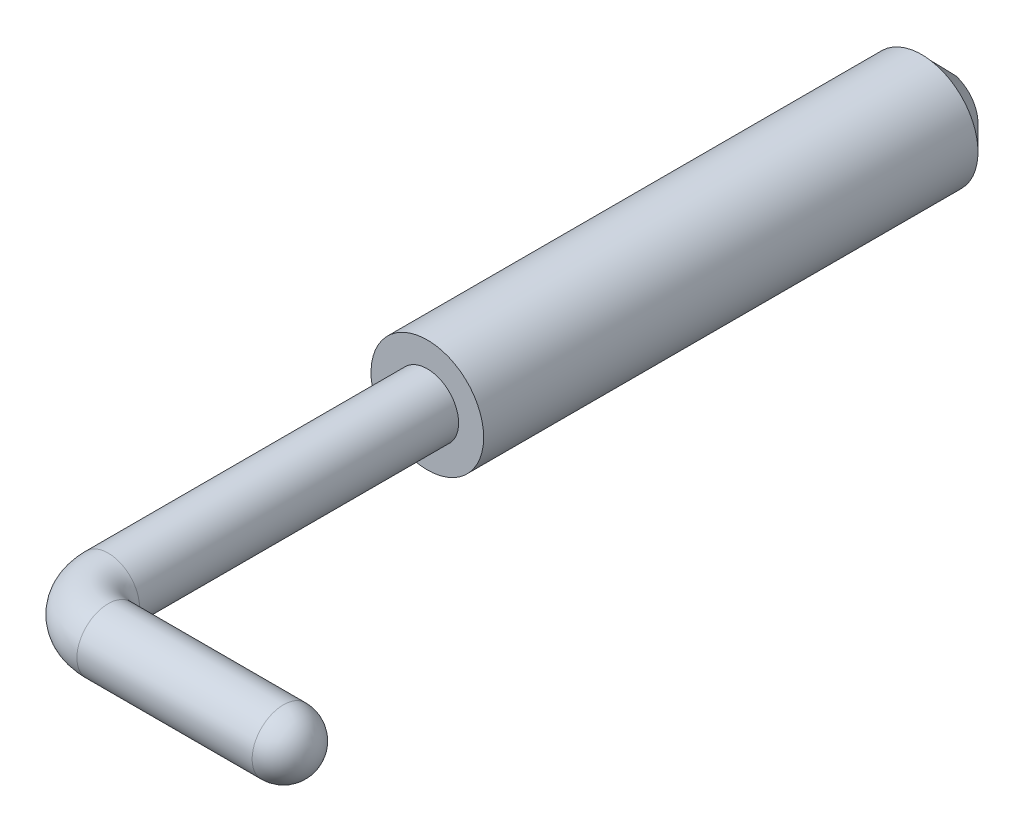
ISO-10303-21;
HEADER;
FILE_DESCRIPTION(('STEP AP214'),'2;1');
FILE_NAME('part.step','',(''),(''),'','','');
FILE_SCHEMA(('AUTOMOTIVE_DESIGN { 1 0 10303 214 1 1 1 1 }'));
ENDSEC;
DATA;
#1=APPLICATION_CONTEXT('core data for automotive mechanical design processes');
#2=APPLICATION_PROTOCOL_DEFINITION('international standard','automotive_design',2000,#1);
#3=PRODUCT_CONTEXT('',#1,'mechanical');
#4=PRODUCT('Part','Part','',(#3));
#5=PRODUCT_RELATED_PRODUCT_CATEGORY('part','',(#4));
#6=PRODUCT_DEFINITION_FORMATION('','',#4);
#7=PRODUCT_DEFINITION_CONTEXT('part definition',#1,'design');
#8=PRODUCT_DEFINITION('design','',#6,#7);
#9=PRODUCT_DEFINITION_SHAPE('','',#8);
#10=(LENGTH_UNIT() NAMED_UNIT(*) SI_UNIT(.MILLI.,.METRE.));
#11=(NAMED_UNIT(*) PLANE_ANGLE_UNIT() SI_UNIT($,.RADIAN.));
#12=(NAMED_UNIT(*) SI_UNIT($,.STERADIAN.) SOLID_ANGLE_UNIT());
#13=UNCERTAINTY_MEASURE_WITH_UNIT(LENGTH_MEASURE(1.E-05),#10,'distance_accuracy_value','');
#14=(GEOMETRIC_REPRESENTATION_CONTEXT(3) GLOBAL_UNCERTAINTY_ASSIGNED_CONTEXT((#13)) GLOBAL_UNIT_ASSIGNED_CONTEXT((#10,
#11,#12)) REPRESENTATION_CONTEXT('',''));
#15=CARTESIAN_POINT('',(0.,0.,0.));
#16=DIRECTION('',(0.,0.,1.));
#17=DIRECTION('',(1.,0.,0.));
#18=AXIS2_PLACEMENT_3D('',#15,#16,#17);
#19=CARTESIAN_POINT('',(0.,0.,20.5));
#20=DIRECTION('',(0.,0.,-1.));
#21=DIRECTION('',(0.,1.,0.));
#22=AXIS2_PLACEMENT_3D('',#19,#20,#21);
#23=CYLINDRICAL_SURFACE('',#22,4.5);
#24=CARTESIAN_POINT('',(0.,0.,2.));
#25=DIRECTION('',(0.,0.,-1.));
#26=DIRECTION('',(0.,1.,0.));
#27=AXIS2_PLACEMENT_3D('',#24,#25,#26);
#28=CIRCLE('',#27,4.5);
#29=CARTESIAN_POINT('',(0.75,4.43705983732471,2.));
#30=VERTEX_POINT('',#29);
#31=CARTESIAN_POINT('',(0.75,-4.43705983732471,2.));
#32=VERTEX_POINT('',#31);
#33=EDGE_CURVE('E82',#30,#32,#28,.T.);
#34=ORIENTED_EDGE('',*,*,#33,.F.);
#35=CARTESIAN_POINT('',(-0.75,4.43705983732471,2.));
#36=VERTEX_POINT('',#35);
#37=EDGE_CURVE('E71',#36,#30,#28,.T.);
#38=ORIENTED_EDGE('',*,*,#37,.F.);
#39=CARTESIAN_POINT('',(-0.75,-4.43705983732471,2.));
#40=VERTEX_POINT('',#39);
#41=EDGE_CURVE('E80',#40,#36,#28,.T.);
#42=ORIENTED_EDGE('',*,*,#41,.F.);
#43=EDGE_CURVE('E73',#32,#40,#28,.T.);
#44=ORIENTED_EDGE('',*,*,#43,.F.);
#45=EDGE_LOOP('',(#34,#38,#42,#44));
#46=FACE_BOUND('',#45,.T.);
#47=CARTESIAN_POINT('',(0.,0.,41.5));
#48=DIRECTION('',(0.,0.,1.));
#49=DIRECTION('',(1.,0.,0.));
#50=AXIS2_PLACEMENT_3D('',#47,#48,#49);
#51=CIRCLE('',#50,4.5);
#52=CARTESIAN_POINT('',(4.5,0.,41.5));
#53=VERTEX_POINT('',#52);
#54=EDGE_CURVE('E99',#53,#53,#51,.T.);
#55=ORIENTED_EDGE('',*,*,#54,.F.);
#56=EDGE_LOOP('',(#55));
#57=FACE_BOUND('',#56,.T.);
#58=ADVANCED_FACE('F14',(#46,#57),#23,.T.);
#59=CARTESIAN_POINT('',(0.,0.,2.));
#60=DIRECTION('',(0.,0.,1.));
#61=DIRECTION('',(0.,-1.,0.));
#62=AXIS2_PLACEMENT_3D('',#59,#60,#61);
#63=CONICAL_SURFACE('',#62,4.5,0.785398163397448);
#64=ORIENTED_EDGE('',*,*,#33,.T.);
#65=CARTESIAN_POINT('',(0.75,-10.0038518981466,7.53192667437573));
#66=CARTESIAN_POINT('',(0.749999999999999,-9.64989859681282,7.17897254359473));
#67=CARTESIAN_POINT('',(0.749999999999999,-9.29590105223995,6.82606273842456));
#68=CARTESIAN_POINT('',(0.749999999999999,-8.58774529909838,6.1203799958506));
#69=CARTESIAN_POINT('',(0.749999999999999,-8.23358708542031,5.76760706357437));
#70=CARTESIAN_POINT('',(0.749999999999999,-7.52476552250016,5.06197527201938));
#71=CARTESIAN_POINT('',(0.749999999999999,-7.1701019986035,4.70911658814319));
#72=CARTESIAN_POINT('',(0.75,-6.46046381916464,4.00373594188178));
#73=CARTESIAN_POINT('',(0.75,-6.10548917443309,3.65121396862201));
#74=CARTESIAN_POINT('',(0.75,-5.40975152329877,2.96131238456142));
#75=CARTESIAN_POINT('',(0.75,-5.0690098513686,2.62391127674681));
#76=CARTESIAN_POINT('',(0.75,-4.55722654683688,2.1184538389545));
#77=CARTESIAN_POINT('',(0.75,-4.38651159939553,1.95006683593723));
#78=CARTESIAN_POINT('',(0.75,-4.04477287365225,1.61360981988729));
#79=CARTESIAN_POINT('',(0.75,-3.87374909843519,1.44553980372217));
#80=CARTESIAN_POINT('',(0.75,-3.53133956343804,1.10994417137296));
#81=CARTESIAN_POINT('',(0.75,-3.35995403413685,0.94241832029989));
#82=CARTESIAN_POINT('',(0.75,-3.01648223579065,0.608073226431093));
#83=CARTESIAN_POINT('',(0.75,-2.84439594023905,0.441254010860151));
#84=CARTESIAN_POINT('',(0.75,-2.49912566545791,0.10881113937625));
#85=CARTESIAN_POINT('',(0.75,-2.32594188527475,-0.0568127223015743));
#86=CARTESIAN_POINT('',(0.750000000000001,-2.06459804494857,-0.30357863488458));
#87=CARTESIAN_POINT('',(0.750000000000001,-1.9772248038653,-0.385553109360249));
#88=CARTESIAN_POINT('',(0.75,-1.80171961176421,-0.548684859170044));
#89=CARTESIAN_POINT('',(0.75,-1.71358767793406,-0.629842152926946));
#90=CARTESIAN_POINT('',(0.75,-1.5756678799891,-0.755061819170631));
#91=CARTESIAN_POINT('',(0.750000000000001,-1.52627313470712,-0.799556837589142));
#92=CARTESIAN_POINT('',(0.750000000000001,-1.42702690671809,-0.888045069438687));
#93=CARTESIAN_POINT('',(0.750000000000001,-1.37717538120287,-0.932038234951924));
#94=CARTESIAN_POINT('',(0.750000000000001,-1.27654622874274,-1.01964446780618));
#95=CARTESIAN_POINT('',(0.750000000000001,-1.22576462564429,-1.06325297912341));
#96=CARTESIAN_POINT('',(0.75,-1.12341672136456,-1.14951667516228));
#97=CARTESIAN_POINT('',(0.75,-1.07185062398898,-1.19217210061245));
#98=CARTESIAN_POINT('',(0.75,-0.967224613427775,-1.27645915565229));
#99=CARTESIAN_POINT('',(0.750000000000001,-0.914156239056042,-1.31808033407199));
#100=CARTESIAN_POINT('',(0.750000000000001,-0.806467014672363,-1.39925797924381));
#101=CARTESIAN_POINT('',(0.750000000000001,-0.751846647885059,-1.43881507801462));
#102=CARTESIAN_POINT('',(0.750000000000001,-0.640655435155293,-1.5144650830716));
#103=CARTESIAN_POINT('',(0.750000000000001,-0.584096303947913,-1.55057504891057));
#104=CARTESIAN_POINT('',(0.75,-0.467857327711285,-1.61732056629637));
#105=CARTESIAN_POINT('',(0.749999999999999,-0.408186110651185,-1.64797031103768));
#106=CARTESIAN_POINT('',(0.75,-0.323387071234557,-1.68351479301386));
#107=CARTESIAN_POINT('',(0.750000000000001,-0.300001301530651,-1.69252676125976));
#108=CARTESIAN_POINT('',(0.750000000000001,-0.252663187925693,-1.70889948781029));
#109=CARTESIAN_POINT('',(0.750000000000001,-0.228710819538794,-1.71626017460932));
#110=CARTESIAN_POINT('',(0.75,-0.156244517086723,-1.73529491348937));
#111=CARTESIAN_POINT('',(0.75,-0.106868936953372,-1.74403460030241));
#112=CARTESIAN_POINT('',(0.75,-0.0320177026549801,-1.74974211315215));
#113=CARTESIAN_POINT('',(0.750000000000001,-0.00678852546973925,-1.75039289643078));
#114=CARTESIAN_POINT('',(0.750000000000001,0.0436081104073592,-1.74915527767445));
#115=CARTESIAN_POINT('',(0.750000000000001,0.0687755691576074,-1.74726687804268));
#116=CARTESIAN_POINT('',(0.75,0.143945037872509,-1.73792568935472));
#117=CARTESIAN_POINT('',(0.75,0.19350913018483,-1.72678961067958));
#118=CARTESIAN_POINT('',(0.75,0.277550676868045,-1.70102527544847));
#119=CARTESIAN_POINT('',(0.750000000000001,0.312586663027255,-1.6880694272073));
#120=CARTESIAN_POINT('',(0.750000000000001,0.381421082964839,-1.65916115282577));
#121=CARTESIAN_POINT('',(0.750000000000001,0.41521858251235,-1.64320651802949));
#122=CARTESIAN_POINT('',(0.750000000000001,0.481823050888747,-1.60902814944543));
#123=CARTESIAN_POINT('',(0.750000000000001,0.514624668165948,-1.59079418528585));
#124=CARTESIAN_POINT('',(0.750000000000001,0.579250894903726,-1.55271349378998));
#125=CARTESIAN_POINT('',(0.75,0.61107589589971,-1.53286742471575));
#126=CARTESIAN_POINT('',(0.75,0.679843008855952,-1.48813005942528));
#127=CARTESIAN_POINT('',(0.750000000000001,0.716623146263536,-1.46299140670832));
#128=CARTESIAN_POINT('',(0.750000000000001,0.789315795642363,-1.41148463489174));
#129=CARTESIAN_POINT('',(0.750000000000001,0.825228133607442,-1.38511627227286));
#130=CARTESIAN_POINT('',(0.750000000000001,0.93199827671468,-1.30462929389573));
#131=CARTESIAN_POINT('',(0.750000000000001,1.00183738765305,-1.24916390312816));
#132=CARTESIAN_POINT('',(0.750000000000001,1.13995928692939,-1.13601428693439));
#133=CARTESIAN_POINT('',(0.750000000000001,1.20823774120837,-1.07832485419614));
#134=CARTESIAN_POINT('',(0.750000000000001,1.34360391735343,-0.961625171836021));
#135=CARTESIAN_POINT('',(0.750000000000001,1.41069212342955,-0.902615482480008));
#136=CARTESIAN_POINT('',(0.750000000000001,1.54420103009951,-0.783565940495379));
#137=CARTESIAN_POINT('',(0.750000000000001,1.61062000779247,-0.723524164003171));
#138=CARTESIAN_POINT('',(0.750000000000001,1.74287792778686,-0.602792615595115));
#139=CARTESIAN_POINT('',(0.750000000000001,1.80871680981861,-0.542102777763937));
#140=CARTESIAN_POINT('',(0.750000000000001,1.93985449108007,-0.420350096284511));
#141=CARTESIAN_POINT('',(0.750000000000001,2.00515397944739,-0.359287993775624));
#142=CARTESIAN_POINT('',(0.75,2.13541769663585,-0.236812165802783));
#143=CARTESIAN_POINT('',(0.75,2.20038193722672,-0.175398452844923));
#144=CARTESIAN_POINT('',(0.75,2.39364988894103,0.00807003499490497));
#145=CARTESIAN_POINT('',(0.75,2.52157892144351,0.130519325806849));
#146=CARTESIAN_POINT('',(0.750000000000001,2.77679187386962,0.376088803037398));
#147=CARTESIAN_POINT('',(0.75,2.90407578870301,0.49920899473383));
#148=CARTESIAN_POINT('',(0.75,3.28528686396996,0.869245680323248));
#149=CARTESIAN_POINT('',(0.75,3.53856505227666,1.11683033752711));
#150=CARTESIAN_POINT('',(0.75,4.04439189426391,1.61306203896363));
#151=CARTESIAN_POINT('',(0.75,4.29693998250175,1.86170965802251));
#152=CARTESIAN_POINT('',(0.75,4.8014956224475,2.35954461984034));
#153=CARTESIAN_POINT('',(0.75,5.05350318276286,2.60873195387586));
#154=CARTESIAN_POINT('',(0.75,5.55653338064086,3.10681170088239));
#155=CARTESIAN_POINT('',(0.75,5.80755688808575,3.35570323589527));
#156=CARTESIAN_POINT('',(0.75,6.30937405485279,3.85371998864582));
#157=CARTESIAN_POINT('',(0.749999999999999,6.56016771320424,4.10284520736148));
#158=CARTESIAN_POINT('',(0.75,7.31222477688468,4.85037964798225));
#159=CARTESIAN_POINT('',(0.750000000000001,7.81324790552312,5.3490305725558));
#160=CARTESIAN_POINT('',(0.75,8.45488821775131,5.98807905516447));
#161=CARTESIAN_POINT('',(0.749999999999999,8.59566588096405,6.12831559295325));
#162=CARTESIAN_POINT('',(0.749999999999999,8.87720033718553,6.40881797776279));
#163=CARTESIAN_POINT('',(0.749999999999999,9.01795712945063,6.54908382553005));
#164=CARTESIAN_POINT('',(0.749999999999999,9.29958317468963,6.82977040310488));
#165=CARTESIAN_POINT('',(0.749999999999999,9.4404524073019,6.97019115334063));
#166=CARTESIAN_POINT('',(0.749999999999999,9.72216778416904,7.25104742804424));
#167=CARTESIAN_POINT('',(0.749999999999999,9.8630139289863,7.39148295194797));
#168=CARTESIAN_POINT('',(0.75,10.0038518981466,7.53192667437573));
#169=B_SPLINE_CURVE_WITH_KNOTS('',3,(#65,#66,#67,#68,#69,#70,#71,#72,#73,#74,#75,#76,#77,#78,
#79,#80,#81,#82,#83,#84,#85,#86,#87,#88,#89,#90,#91,#92,#93,#94,#95,#96,#97,#98,#99,#100,#101,
#102,#103,#104,#105,#106,#107,#108,#109,#110,#111,#112,#113,#114,#115,#116,#117,#118,#119,#120,
#121,#122,#123,#124,#125,#126,#127,#128,#129,#130,#131,#132,#133,#134,#135,#136,#137,#138,#139,
#140,#141,#142,#143,#144,#145,#146,#147,#148,#149,#150,#151,#152,#153,#154,#155,#156,#157,#158,
#159,#160,#161,#162,#163,#164,#165,#166,#167,#168),.UNSPECIFIED.,.F.,.F.,(4,2,2,2,2,2,2,2,2,2,2,
2,2,2,2,2,2,2,2,2,2,2,2,2,2,2,2,2,2,2,2,2,2,2,2,2,2,2,2,2,2,2,2,2,2,2,2,2,2,2,2,4),(0.,
1.49957865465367,2.99920891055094,4.50009489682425,6.00093064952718,7.43950511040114,
8.15886563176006,8.87821900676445,9.59720365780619,10.3162157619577,11.0351009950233,
11.3945213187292,11.7539335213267,11.9533723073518,12.1528299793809,12.3536311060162,
12.5543809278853,12.756681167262,12.9589190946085,13.1600977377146,13.3607455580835,
13.4358753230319,13.5110083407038,13.6604526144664,13.7360496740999,13.8116466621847,
13.9631506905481,14.0750739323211,14.1870799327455,14.2996080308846,14.4120904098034,
14.5457058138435,14.6793477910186,14.9468192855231,15.2149604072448,15.482989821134,
15.7515892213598,16.020216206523,16.2884186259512,16.5566115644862,17.0878668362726,
17.6191262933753,18.6816796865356,19.7449078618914,20.808118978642,21.8686084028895,
22.9291022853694,25.049736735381,25.6458589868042,26.2419989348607,26.8387058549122,
27.4353950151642),.UNSPECIFIED.);
#170=CARTESIAN_POINT('',(0.75,-2.38484800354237,0.));
#171=VERTEX_POINT('',#170);
#172=EDGE_CURVE('E39',#32,#171,#169,.T.);
#173=ORIENTED_EDGE('',*,*,#172,.T.);
#174=CARTESIAN_POINT('',(0.,0.,0.));
#175=DIRECTION('',(0.,0.,-1.));
#176=DIRECTION('',(0.,1.,0.));
#177=AXIS2_PLACEMENT_3D('',#174,#175,#176);
#178=CIRCLE('',#177,2.5);
#179=CARTESIAN_POINT('',(0.75,2.38484800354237,0.));
#180=VERTEX_POINT('',#179);
#181=EDGE_CURVE('E83',#180,#171,#178,.T.);
#182=ORIENTED_EDGE('',*,*,#181,.F.);
#183=EDGE_CURVE('E66',#180,#30,#169,.T.);
#184=ORIENTED_EDGE('',*,*,#183,.T.);
#185=EDGE_LOOP('',(#64,#173,#182,#184));
#186=FACE_BOUND('',#185,.T.);
#187=ADVANCED_FACE('F139',(#186),#63,.T.);
#188=CARTESIAN_POINT('',(0.,0.,0.));
#189=DIRECTION('',(0.,0.,1.));
#190=DIRECTION('',(0.,-1.,0.));
#191=AXIS2_PLACEMENT_3D('',#188,#189,#190);
#192=PLANE('',#191);
#193=ORIENTED_EDGE('',*,*,#181,.T.);
#194=DIRECTION('',(0.,1.,0.));
#195=VECTOR('',#194,1.);
#196=CARTESIAN_POINT('',(0.75,0.,0.));
#197=LINE('',#196,#195);
#198=EDGE_CURVE('E23',#171,#180,#197,.T.);
#199=ORIENTED_EDGE('',*,*,#198,.T.);
#200=EDGE_LOOP('',(#193,#199));
#201=FACE_BOUND('',#200,.T.);
#202=ADVANCED_FACE('F133',(#201),#192,.F.);
#203=ORIENTED_EDGE('',*,*,#41,.T.);
#204=CARTESIAN_POINT('',(-0.75,10.0038518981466,7.53192667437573));
#205=CARTESIAN_POINT('',(-0.75,9.64989859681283,7.17897254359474));
#206=CARTESIAN_POINT('',(-0.75,9.29590105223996,6.82606273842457));
#207=CARTESIAN_POINT('',(-0.75,8.5877452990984,6.12037999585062));
#208=CARTESIAN_POINT('',(-0.75,8.23358708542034,5.7676070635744));
#209=CARTESIAN_POINT('',(-0.75,7.5247655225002,5.06197527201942));
#210=CARTESIAN_POINT('',(-0.75,7.17010199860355,4.70911658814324));
#211=CARTESIAN_POINT('',(-0.75,6.4604638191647,4.00373594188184));
#212=CARTESIAN_POINT('',(-0.75,6.10548917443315,3.65121396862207));
#213=CARTESIAN_POINT('',(-0.75,5.40975152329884,2.96131238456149));
#214=CARTESIAN_POINT('',(-0.75,5.06900985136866,2.62391127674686));
#215=CARTESIAN_POINT('',(-0.75,4.55722654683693,2.11845383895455));
#216=CARTESIAN_POINT('',(-0.75,4.38651159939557,1.95006683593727));
#217=CARTESIAN_POINT('',(-0.75,4.04477287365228,1.61360981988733));
#218=CARTESIAN_POINT('',(-0.75,3.87374909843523,1.4455398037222));
#219=CARTESIAN_POINT('',(-0.75,3.53133956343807,1.10994417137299));
#220=CARTESIAN_POINT('',(-0.75,3.35995403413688,0.942418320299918));
#221=CARTESIAN_POINT('',(-0.75,3.01648223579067,0.608073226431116));
#222=CARTESIAN_POINT('',(-0.75,2.84439594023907,0.441254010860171));
#223=CARTESIAN_POINT('',(-0.75,2.49912566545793,0.108811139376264));
#224=CARTESIAN_POINT('',(-0.75,2.32594188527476,-0.0568127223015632));
#225=CARTESIAN_POINT('',(-0.75,2.06459804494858,-0.303578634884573));
#226=CARTESIAN_POINT('',(-0.75,1.9772248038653,-0.385553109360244));
#227=CARTESIAN_POINT('',(-0.75,1.80171961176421,-0.548684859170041));
#228=CARTESIAN_POINT('',(-0.75,1.71358767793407,-0.629842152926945));
#229=CARTESIAN_POINT('',(-0.75,1.5756678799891,-0.755061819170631));
#230=CARTESIAN_POINT('',(-0.75,1.52627313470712,-0.799556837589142));
#231=CARTESIAN_POINT('',(-0.75,1.42702690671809,-0.888045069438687));
#232=CARTESIAN_POINT('',(-0.75,1.37717538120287,-0.932038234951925));
#233=CARTESIAN_POINT('',(-0.75,1.27654622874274,-1.01964446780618));
#234=CARTESIAN_POINT('',(-0.75,1.22576462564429,-1.06325297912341));
#235=CARTESIAN_POINT('',(-0.75,1.12341672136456,-1.14951667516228));
#236=CARTESIAN_POINT('',(-0.75,1.07185062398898,-1.19217210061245));
#237=CARTESIAN_POINT('',(-0.75,0.967224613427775,-1.27645915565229));
#238=CARTESIAN_POINT('',(-0.75,0.914156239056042,-1.31808033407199));
#239=CARTESIAN_POINT('',(-0.75,0.806467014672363,-1.39925797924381));
#240=CARTESIAN_POINT('',(-0.75,0.75184664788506,-1.43881507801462));
#241=CARTESIAN_POINT('',(-0.75,0.640655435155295,-1.5144650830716));
#242=CARTESIAN_POINT('',(-0.749999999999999,0.584096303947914,-1.55057504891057));
#243=CARTESIAN_POINT('',(-0.75,0.467857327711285,-1.61732056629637));
#244=CARTESIAN_POINT('',(-0.75,0.408186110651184,-1.64797031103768));
#245=CARTESIAN_POINT('',(-0.75,0.323387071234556,-1.68351479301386));
#246=CARTESIAN_POINT('',(-0.75,0.30000130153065,-1.69252676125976));
#247=CARTESIAN_POINT('',(-0.749999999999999,0.252663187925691,-1.7088994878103));
#248=CARTESIAN_POINT('',(-0.749999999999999,0.228710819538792,-1.71626017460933));
#249=CARTESIAN_POINT('',(-0.75,0.156244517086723,-1.73529491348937));
#250=CARTESIAN_POINT('',(-0.75,0.106868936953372,-1.74403460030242));
#251=CARTESIAN_POINT('',(-0.75,0.0320177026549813,-1.74974211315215));
#252=CARTESIAN_POINT('',(-0.75,0.00678852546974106,-1.75039289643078));
#253=CARTESIAN_POINT('',(-0.749999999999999,-0.0436081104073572,-1.74915527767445));
#254=CARTESIAN_POINT('',(-0.749999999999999,-0.068775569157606,-1.74726687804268));
#255=CARTESIAN_POINT('',(-0.75,-0.143945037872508,-1.73792568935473));
#256=CARTESIAN_POINT('',(-0.75,-0.193509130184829,-1.72678961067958));
#257=CARTESIAN_POINT('',(-0.75,-0.277550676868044,-1.70102527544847));
#258=CARTESIAN_POINT('',(-0.75,-0.312586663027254,-1.68806942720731));
#259=CARTESIAN_POINT('',(-0.749999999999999,-0.381421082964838,-1.65916115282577));
#260=CARTESIAN_POINT('',(-0.75,-0.41521858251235,-1.64320651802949));
#261=CARTESIAN_POINT('',(-0.75,-0.481823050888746,-1.60902814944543));
#262=CARTESIAN_POINT('',(-0.749999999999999,-0.514624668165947,-1.59079418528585));
#263=CARTESIAN_POINT('',(-0.75,-0.579250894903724,-1.55271349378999));
#264=CARTESIAN_POINT('',(-0.75,-0.611075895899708,-1.53286742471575));
#265=CARTESIAN_POINT('',(-0.75,-0.67984300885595,-1.48813005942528));
#266=CARTESIAN_POINT('',(-0.75,-0.716623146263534,-1.46299140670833));
#267=CARTESIAN_POINT('',(-0.75,-0.789315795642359,-1.41148463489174));
#268=CARTESIAN_POINT('',(-0.75,-0.825228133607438,-1.38511627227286));
#269=CARTESIAN_POINT('',(-0.75,-0.931998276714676,-1.30462929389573));
#270=CARTESIAN_POINT('',(-0.75,-1.00183738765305,-1.24916390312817));
#271=CARTESIAN_POINT('',(-0.75,-1.13995928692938,-1.13601428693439));
#272=CARTESIAN_POINT('',(-0.75,-1.20823774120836,-1.07832485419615));
#273=CARTESIAN_POINT('',(-0.75,-1.34360391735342,-0.961625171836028));
#274=CARTESIAN_POINT('',(-0.75,-1.41069212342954,-0.902615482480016));
#275=CARTESIAN_POINT('',(-0.75,-1.5442010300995,-0.783565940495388));
#276=CARTESIAN_POINT('',(-0.75,-1.61062000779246,-0.72352416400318));
#277=CARTESIAN_POINT('',(-0.75,-1.74287792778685,-0.602792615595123));
#278=CARTESIAN_POINT('',(-0.75,-1.8087168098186,-0.542102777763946));
#279=CARTESIAN_POINT('',(-0.75,-1.93985449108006,-0.420350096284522));
#280=CARTESIAN_POINT('',(-0.75,-2.00515397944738,-0.359287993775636));
#281=CARTESIAN_POINT('',(-0.75,-2.13541769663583,-0.236812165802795));
#282=CARTESIAN_POINT('',(-0.75,-2.20038193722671,-0.175398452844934));
#283=CARTESIAN_POINT('',(-0.75,-2.39364988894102,0.00807003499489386));
#284=CARTESIAN_POINT('',(-0.75,-2.5215789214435,0.130519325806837));
#285=CARTESIAN_POINT('',(-0.75,-2.77679187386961,0.376088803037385));
#286=CARTESIAN_POINT('',(-0.75,-2.904075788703,0.499208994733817));
#287=CARTESIAN_POINT('',(-0.75,-3.28528686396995,0.869245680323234));
#288=CARTESIAN_POINT('',(-0.75,-3.53856505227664,1.1168303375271));
#289=CARTESIAN_POINT('',(-0.75,-4.0443918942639,1.61306203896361));
#290=CARTESIAN_POINT('',(-0.75,-4.29693998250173,1.86170965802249));
#291=CARTESIAN_POINT('',(-0.75,-4.80149562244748,2.35954461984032));
#292=CARTESIAN_POINT('',(-0.75,-5.05350318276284,2.60873195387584));
#293=CARTESIAN_POINT('',(-0.75,-5.55653338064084,3.10681170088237));
#294=CARTESIAN_POINT('',(-0.75,-5.80755688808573,3.35570323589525));
#295=CARTESIAN_POINT('',(-0.75,-6.30937405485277,3.85371998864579));
#296=CARTESIAN_POINT('',(-0.75,-6.56016771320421,4.10284520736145));
#297=CARTESIAN_POINT('',(-0.75,-7.31222477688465,4.85037964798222));
#298=CARTESIAN_POINT('',(-0.75,-7.8132479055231,5.34903057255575));
#299=CARTESIAN_POINT('',(-0.75,-8.45488821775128,5.98807905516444));
#300=CARTESIAN_POINT('',(-0.75,-8.59566588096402,6.12831559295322));
#301=CARTESIAN_POINT('',(-0.750000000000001,-8.8772003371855,6.40881797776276));
#302=CARTESIAN_POINT('',(-0.750000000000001,-9.01795712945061,6.54908382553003));
#303=CARTESIAN_POINT('',(-0.750000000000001,-9.29958317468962,6.82977040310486));
#304=CARTESIAN_POINT('',(-0.750000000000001,-9.44045240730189,6.97019115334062));
#305=CARTESIAN_POINT('',(-0.750000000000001,-9.72216778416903,7.25104742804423));
#306=CARTESIAN_POINT('',(-0.75,-9.8630139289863,7.39148295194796));
#307=CARTESIAN_POINT('',(-0.75,-10.0038518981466,7.53192667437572));
#308=B_SPLINE_CURVE_WITH_KNOTS('',3,(#204,#205,#206,#207,#208,#209,#210,#211,#212,#213,#214,
#215,#216,#217,#218,#219,#220,#221,#222,#223,#224,#225,#226,#227,#228,#229,#230,#231,#232,#233,
#234,#235,#236,#237,#238,#239,#240,#241,#242,#243,#244,#245,#246,#247,#248,#249,#250,#251,#252,
#253,#254,#255,#256,#257,#258,#259,#260,#261,#262,#263,#264,#265,#266,#267,#268,#269,#270,#271,
#272,#273,#274,#275,#276,#277,#278,#279,#280,#281,#282,#283,#284,#285,#286,#287,#288,#289,#290,
#291,#292,#293,#294,#295,#296,#297,#298,#299,#300,#301,#302,#303,#304,#305,#306,#307),
.UNSPECIFIED.,.F.,.F.,(4,2,2,2,2,2,2,2,2,2,2,2,2,2,2,2,2,2,2,2,2,2,2,2,2,2,2,2,2,2,2,2,2,2,2,2,
2,2,2,2,2,2,2,2,2,2,2,2,2,2,2,4),(0.,1.49957865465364,2.99920891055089,4.50009489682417,
6.00093064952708,7.43950511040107,8.15886563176,8.8782190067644,9.59720365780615,
10.3162157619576,11.0351009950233,11.3945213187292,11.7539335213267,11.9533723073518,
12.1528299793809,12.3536311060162,12.5543809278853,12.756681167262,12.9589190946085,
13.1600977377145,13.3607455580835,13.4358753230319,13.5110083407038,13.6604526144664,
13.7360496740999,13.8116466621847,13.9631506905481,14.0750739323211,14.1870799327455,
14.2996080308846,14.4120904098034,14.5457058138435,14.6793477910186,14.9468192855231,
15.2149604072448,15.482989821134,15.7515892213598,16.020216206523,16.2884186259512,
16.5566115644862,17.0878668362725,17.6191262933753,18.6816796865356,19.7449078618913,
20.808118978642,21.8686084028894,22.9291022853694,25.049736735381,25.6458589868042,
26.2419989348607,26.8387058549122,27.4353950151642),.UNSPECIFIED.);
#309=CARTESIAN_POINT('',(-0.75,2.38484800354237,0.));
#310=VERTEX_POINT('',#309);
#311=EDGE_CURVE('E57',#36,#310,#308,.T.);
#312=ORIENTED_EDGE('',*,*,#311,.T.);
#313=CARTESIAN_POINT('',(-0.75,-2.38484800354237,0.));
#314=VERTEX_POINT('',#313);
#315=EDGE_CURVE('E181',#314,#310,#178,.T.);
#316=ORIENTED_EDGE('',*,*,#315,.F.);
#317=EDGE_CURVE('E31',#314,#40,#308,.T.);
#318=ORIENTED_EDGE('',*,*,#317,.T.);
#319=EDGE_LOOP('',(#203,#312,#316,#318));
#320=FACE_BOUND('',#319,.T.);
#321=ADVANCED_FACE('F85',(#320),#63,.T.);
#322=ORIENTED_EDGE('',*,*,#315,.T.);
#323=DIRECTION('',(0.,-1.,0.));
#324=VECTOR('',#323,1.);
#325=CARTESIAN_POINT('',(-0.75,0.,0.));
#326=LINE('',#325,#324);
#327=EDGE_CURVE('E61',#310,#314,#326,.T.);
#328=ORIENTED_EDGE('',*,*,#327,.T.);
#329=EDGE_LOOP('',(#322,#328));
#330=FACE_BOUND('',#329,.T.);
#331=ADVANCED_FACE('F128',(#330),#192,.F.);
#332=CARTESIAN_POINT('',(0.75,5.,2.));
#333=DIRECTION('',(0.,0.,1.));
#334=DIRECTION('',(-1.,0.,0.));
#335=AXIS2_PLACEMENT_3D('',#332,#333,#334);
#336=PLANE('',#335);
#337=DIRECTION('',(0.,-1.,0.));
#338=VECTOR('',#337,1.);
#339=CARTESIAN_POINT('',(-0.75,5.,2.));
#340=LINE('',#339,#338);
#341=EDGE_CURVE('E60',#36,#40,#340,.T.);
#342=ORIENTED_EDGE('',*,*,#341,.F.);
#343=ORIENTED_EDGE('',*,*,#37,.T.);
#344=DIRECTION('',(0.,-1.,0.));
#345=VECTOR('',#344,1.);
#346=CARTESIAN_POINT('',(0.75,5.,2.));
#347=LINE('',#346,#345);
#348=EDGE_CURVE('E74',#30,#32,#347,.T.);
#349=ORIENTED_EDGE('',*,*,#348,.T.);
#350=ORIENTED_EDGE('',*,*,#43,.T.);
#351=EDGE_LOOP('',(#342,#343,#349,#350));
#352=FACE_BOUND('',#351,.T.);
#353=ADVANCED_FACE('F70',(#352),#336,.F.);
#354=CARTESIAN_POINT('',(0.75,5.,2.));
#355=DIRECTION('',(1.,0.,0.));
#356=DIRECTION('',(0.,0.,1.));
#357=AXIS2_PLACEMENT_3D('',#354,#355,#356);
#358=PLANE('',#357);
#359=ORIENTED_EDGE('',*,*,#348,.F.);
#360=ORIENTED_EDGE('',*,*,#183,.F.);
#361=ORIENTED_EDGE('',*,*,#198,.F.);
#362=ORIENTED_EDGE('',*,*,#172,.F.);
#363=EDGE_LOOP('',(#359,#360,#361,#362));
#364=FACE_BOUND('',#363,.T.);
#365=ADVANCED_FACE('F126',(#364),#358,.F.);
#366=CARTESIAN_POINT('',(-0.75,5.,2.));
#367=DIRECTION('',(-1.,0.,0.));
#368=DIRECTION('',(0.,0.,-1.));
#369=AXIS2_PLACEMENT_3D('',#366,#367,#368);
#370=PLANE('',#369);
#371=ORIENTED_EDGE('',*,*,#341,.T.);
#372=ORIENTED_EDGE('',*,*,#317,.F.);
#373=ORIENTED_EDGE('',*,*,#327,.F.);
#374=ORIENTED_EDGE('',*,*,#311,.F.);
#375=EDGE_LOOP('',(#371,#372,#373,#374));
#376=FACE_BOUND('',#375,.T.);
#377=ADVANCED_FACE('F59',(#376),#370,.F.);
#378=CARTESIAN_POINT('',(0.,0.,41.5));
#379=DIRECTION('',(0.,0.,1.));
#380=DIRECTION('',(1.,0.,0.));
#381=AXIS2_PLACEMENT_3D('',#378,#379,#380);
#382=PLANE('',#381);
#383=CARTESIAN_POINT('',(0.,0.,41.5));
#384=DIRECTION('',(0.,0.,1.));
#385=DIRECTION('',(1.,0.,0.));
#386=AXIS2_PLACEMENT_3D('',#383,#384,#385);
#387=CIRCLE('',#386,2.5);
#388=CARTESIAN_POINT('',(2.5,0.,41.5));
#389=VERTEX_POINT('',#388);
#390=EDGE_CURVE('E9',#389,#389,#387,.T.);
#391=ORIENTED_EDGE('',*,*,#390,.F.);
#392=EDGE_LOOP('',(#391));
#393=FACE_BOUND('',#392,.T.);
#394=ORIENTED_EDGE('',*,*,#54,.T.);
#395=EDGE_LOOP('',(#394));
#396=FACE_BOUND('',#395,.T.);
#397=ADVANCED_FACE('F125',(#393,#396),#382,.T.);
#398=CARTESIAN_POINT('',(17.5,0.,70.5));
#399=DIRECTION('',(0.,0.,-1.));
#400=DIRECTION('',(1.,0.,0.));
#401=AXIS2_PLACEMENT_3D('',#398,#399,#400);
#402=SPHERICAL_SURFACE('',#401,2.5);
#403=CARTESIAN_POINT('',(17.5,0.,70.5));
#404=DIRECTION('',(-1.,0.,0.));
#405=DIRECTION('',(0.,0.,-1.));
#406=AXIS2_PLACEMENT_3D('',#403,#404,#405);
#407=SPHERICAL_SURFACE('',#406,2.5);
#408=CARTESIAN_POINT('',(17.5,0.,70.5));
#409=DIRECTION('',(-1.,0.,0.));
#410=DIRECTION('',(0.,0.,-1.));
#411=AXIS2_PLACEMENT_3D('',#408,#409,#410);
#412=CIRCLE('',#411,2.5);
#413=CARTESIAN_POINT('',(17.5,0.,68.));
#414=VERTEX_POINT('',#413);
#415=EDGE_CURVE('E18',#414,#414,#412,.T.);
#416=ORIENTED_EDGE('',*,*,#415,.F.);
#417=EDGE_LOOP('',(#416));
#418=FACE_BOUND('',#417,.T.);
#419=ADVANCED_FACE('F16',(#418),#407,.T.);
#420=CARTESIAN_POINT('',(3.5,0.,70.5));
#421=DIRECTION('',(1.,0.,0.));
#422=DIRECTION('',(0.,0.,1.));
#423=AXIS2_PLACEMENT_3D('',#420,#421,#422);
#424=CYLINDRICAL_SURFACE('',#423,2.5);
#425=CARTESIAN_POINT('',(3.5,0.,70.5));
#426=DIRECTION('',(-1.,0.,0.));
#427=DIRECTION('',(0.,0.,-1.));
#428=AXIS2_PLACEMENT_3D('',#425,#426,#427);
#429=CIRCLE('',#428,2.5);
#430=CARTESIAN_POINT('',(3.5,0.,73.));
#431=VERTEX_POINT('',#430);
#432=EDGE_CURVE('E94',#431,#431,#429,.T.);
#433=ORIENTED_EDGE('',*,*,#432,.F.);
#434=EDGE_LOOP('',(#433));
#435=FACE_BOUND('',#434,.T.);
#436=ORIENTED_EDGE('',*,*,#415,.T.);
#437=EDGE_LOOP('',(#436));
#438=FACE_BOUND('',#437,.T.);
#439=ADVANCED_FACE('F143',(#435,#438),#424,.T.);
#440=CARTESIAN_POINT('',(3.5,0.,67.));
#441=DIRECTION('',(0.,1.,0.));
#442=DIRECTION('',(0.,0.,1.));
#443=AXIS2_PLACEMENT_3D('',#440,#441,#442);
#444=TOROIDAL_SURFACE('',#443,3.5,2.5);
#445=CARTESIAN_POINT('',(0.,0.,67.));
#446=DIRECTION('',(0.,0.,-1.));
#447=DIRECTION('',(1.,0.,0.));
#448=AXIS2_PLACEMENT_3D('',#445,#446,#447);
#449=CIRCLE('',#448,2.5);
#450=CARTESIAN_POINT('',(-2.5,0.,67.));
#451=VERTEX_POINT('',#450);
#452=EDGE_CURVE('E92',#451,#451,#449,.T.);
#453=CARTESIAN_POINT('',(3.5,0.,67.));
#454=DIRECTION('',(0.,1.,0.));
#455=DIRECTION('',(0.,0.,1.));
#456=AXIS2_PLACEMENT_3D('',#453,#454,#455);
#457=CIRCLE('',#456,6.);
#458=EDGE_CURVE('',#451,#431,#457,.T.);
#459=ORIENTED_EDGE('',*,*,#452,.F.);
#460=ORIENTED_EDGE('',*,*,#432,.T.);
#461=ORIENTED_EDGE('',*,*,#458,.T.);
#462=ORIENTED_EDGE('',*,*,#458,.F.);
#463=EDGE_LOOP('',(#459,#461,#460,#462));
#464=FACE_BOUND('',#463,.T.);
#465=ADVANCED_FACE('F150',(#464),#444,.T.);
#466=CARTESIAN_POINT('',(0.,0.,67.));
#467=DIRECTION('',(0.,0.,-1.));
#468=DIRECTION('',(1.,0.,0.));
#469=AXIS2_PLACEMENT_3D('',#466,#467,#468);
#470=CYLINDRICAL_SURFACE('',#469,2.5);
#471=ORIENTED_EDGE('',*,*,#390,.T.);
#472=EDGE_LOOP('',(#471));
#473=FACE_BOUND('',#472,.T.);
#474=ORIENTED_EDGE('',*,*,#452,.T.);
#475=EDGE_LOOP('',(#474));
#476=FACE_BOUND('',#475,.T.);
#477=ADVANCED_FACE('F158',(#473,#476),#470,.T.);
#478=CLOSED_SHELL('',(#58,#187,#202,#321,#331,#353,#365,#377,#397,#419,#439,#465,#477));
#479=MANIFOLD_SOLID_BREP('B1',#478);
#480=ADVANCED_BREP_SHAPE_REPRESENTATION('',(#18,#479),#14);
#481=SHAPE_DEFINITION_REPRESENTATION(#9,#480);
ENDSEC;
END-ISO-10303-21;
